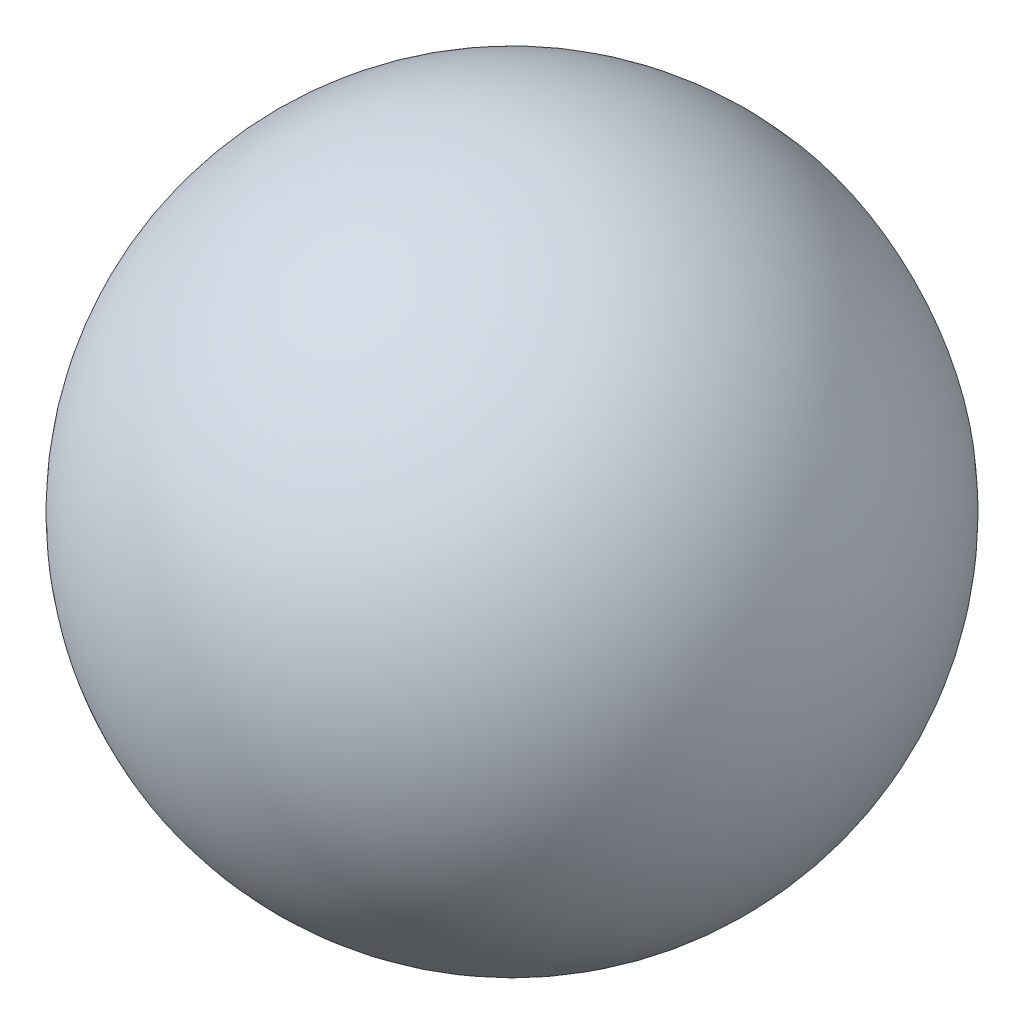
ISO-10303-21;
HEADER;
FILE_DESCRIPTION(('STEP AP214'),'2;1');
FILE_NAME('part.step','',(''),(''),'','','');
FILE_SCHEMA(('AUTOMOTIVE_DESIGN { 1 0 10303 214 1 1 1 1 }'));
ENDSEC;
DATA;
#1=APPLICATION_CONTEXT('core data for automotive mechanical design processes');
#2=APPLICATION_PROTOCOL_DEFINITION('international standard','automotive_design',2000,#1);
#3=PRODUCT_CONTEXT('',#1,'mechanical');
#4=PRODUCT('Part','Part','',(#3));
#5=PRODUCT_RELATED_PRODUCT_CATEGORY('part','',(#4));
#6=PRODUCT_DEFINITION_FORMATION('','',#4);
#7=PRODUCT_DEFINITION_CONTEXT('part definition',#1,'design');
#8=PRODUCT_DEFINITION('design','',#6,#7);
#9=PRODUCT_DEFINITION_SHAPE('','',#8);
#10=(LENGTH_UNIT() NAMED_UNIT(*) SI_UNIT(.MILLI.,.METRE.));
#11=(NAMED_UNIT(*) PLANE_ANGLE_UNIT() SI_UNIT($,.RADIAN.));
#12=(NAMED_UNIT(*) SI_UNIT($,.STERADIAN.) SOLID_ANGLE_UNIT());
#13=UNCERTAINTY_MEASURE_WITH_UNIT(LENGTH_MEASURE(1.E-05),#10,'distance_accuracy_value','');
#14=(GEOMETRIC_REPRESENTATION_CONTEXT(3) GLOBAL_UNCERTAINTY_ASSIGNED_CONTEXT((#13)) GLOBAL_UNIT_ASSIGNED_CONTEXT((#10,
#11,#12)) REPRESENTATION_CONTEXT('',''));
#15=CARTESIAN_POINT('',(0.,0.,0.));
#16=DIRECTION('',(0.,0.,1.));
#17=DIRECTION('',(1.,0.,0.));
#18=AXIS2_PLACEMENT_3D('',#15,#16,#17);
#19=CARTESIAN_POINT('',(0.,0.,9.5));
#20=DIRECTION('',(0.,0.,1.));
#21=DIRECTION('',(0.,1.,0.));
#22=AXIS2_PLACEMENT_3D('',#19,#20,#21);
#23=SPHERICAL_SURFACE('',#22,12.5);
#24=CARTESIAN_POINT('',(0.,0.,0.));
#25=DIRECTION('',(0.,0.,1.));
#26=DIRECTION('',(1.,0.,0.));
#27=AXIS2_PLACEMENT_3D('',#24,#25,#26);
#28=CIRCLE('',#27,8.12403840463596);
#29=CARTESIAN_POINT('',(8.12403840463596,0.,0.));
#30=VERTEX_POINT('',#29);
#31=EDGE_CURVE('E23',#30,#30,#28,.T.);
#32=ORIENTED_EDGE('',*,*,#31,.T.);
#33=EDGE_LOOP('',(#32));
#34=FACE_BOUND('',#33,.T.);
#35=ADVANCED_FACE('F12',(#34),#23,.T.);
#36=CARTESIAN_POINT('',(0.,0.,0.));
#37=DIRECTION('',(0.,0.,1.));
#38=DIRECTION('',(1.,0.,0.));
#39=AXIS2_PLACEMENT_3D('',#36,#37,#38);
#40=PLANE('',#39);
#41=CARTESIAN_POINT('',(0.,0.,0.));
#42=DIRECTION('',(0.,0.,1.));
#43=DIRECTION('',(1.,0.,0.));
#44=AXIS2_PLACEMENT_3D('',#41,#42,#43);
#45=CIRCLE('',#44,4.5);
#46=CARTESIAN_POINT('',(4.5,0.,0.));
#47=VERTEX_POINT('',#46);
#48=EDGE_CURVE('E8',#47,#47,#45,.T.);
#49=ORIENTED_EDGE('',*,*,#48,.T.);
#50=EDGE_LOOP('',(#49));
#51=FACE_BOUND('',#50,.T.);
#52=ORIENTED_EDGE('',*,*,#31,.F.);
#53=EDGE_LOOP('',(#52));
#54=FACE_BOUND('',#53,.T.);
#55=ADVANCED_FACE('F37',(#51,#54),#40,.F.);
#56=CARTESIAN_POINT('',(0.,0.,14.));
#57=DIRECTION('',(0.,0.,-1.));
#58=DIRECTION('',(-1.,0.,0.));
#59=AXIS2_PLACEMENT_3D('',#56,#57,#58);
#60=CYLINDRICAL_SURFACE('',#59,4.);
#61=CARTESIAN_POINT('',(0.,0.,0.500000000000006));
#62=DIRECTION('',(0.,0.,1.));
#63=DIRECTION('',(1.,0.,0.));
#64=AXIS2_PLACEMENT_3D('',#61,#62,#63);
#65=CIRCLE('',#64,4.);
#66=CARTESIAN_POINT('',(4.,0.,0.500000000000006));
#67=VERTEX_POINT('',#66);
#68=EDGE_CURVE('E19',#67,#67,#65,.F.);
#69=ORIENTED_EDGE('',*,*,#68,.T.);
#70=EDGE_LOOP('',(#69));
#71=FACE_BOUND('',#70,.T.);
#72=CARTESIAN_POINT('',(0.,0.,14.));
#73=DIRECTION('',(0.,0.,-1.));
#74=DIRECTION('',(-1.,0.,0.));
#75=AXIS2_PLACEMENT_3D('',#72,#73,#74);
#76=CIRCLE('',#75,4.);
#77=CARTESIAN_POINT('',(-4.,0.,14.));
#78=VERTEX_POINT('',#77);
#79=EDGE_CURVE('E27',#78,#78,#76,.T.);
#80=ORIENTED_EDGE('',*,*,#79,.F.);
#81=EDGE_LOOP('',(#80));
#82=FACE_BOUND('',#81,.T.);
#83=ADVANCED_FACE('F35',(#71,#82),#60,.F.);
#84=CARTESIAN_POINT('',(0.,0.,14.));
#85=DIRECTION('',(0.,0.,-1.));
#86=DIRECTION('',(-1.,0.,0.));
#87=AXIS2_PLACEMENT_3D('',#84,#85,#86);
#88=PLANE('',#87);
#89=ORIENTED_EDGE('',*,*,#79,.T.);
#90=EDGE_LOOP('',(#89));
#91=FACE_BOUND('',#90,.T.);
#92=ADVANCED_FACE('F33',(#91),#88,.T.);
#93=CARTESIAN_POINT('',(0.,0.,0.500000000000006));
#94=DIRECTION('',(0.,0.,-1.));
#95=DIRECTION('',(-1.,0.,0.));
#96=AXIS2_PLACEMENT_3D('',#93,#94,#95);
#97=CONICAL_SURFACE('',#96,4.,0.78539816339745);
#98=ORIENTED_EDGE('',*,*,#48,.F.);
#99=EDGE_LOOP('',(#98));
#100=FACE_BOUND('',#99,.T.);
#101=ORIENTED_EDGE('',*,*,#68,.F.);
#102=EDGE_LOOP('',(#101));
#103=FACE_BOUND('',#102,.T.);
#104=ADVANCED_FACE('F14',(#100,#103),#97,.F.);
#105=CLOSED_SHELL('',(#35,#55,#83,#92,#104));
#106=MANIFOLD_SOLID_BREP('B1',#105);
#107=ADVANCED_BREP_SHAPE_REPRESENTATION('',(#18,#106),#14);
#108=SHAPE_DEFINITION_REPRESENTATION(#9,#107);
ENDSEC;
END-ISO-10303-21;
